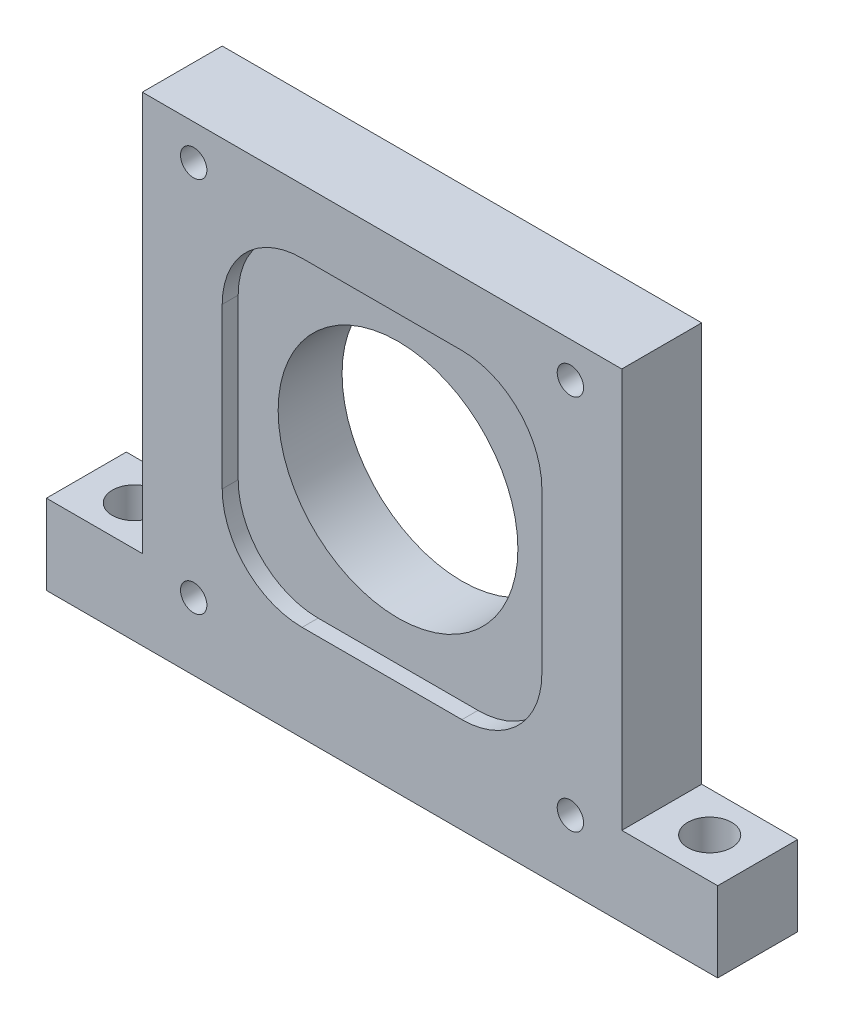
ISO-10303-21;
HEADER;
FILE_DESCRIPTION(('STEP AP214'),'2;1');
FILE_NAME('part.step','',(''),(''),'','','');
FILE_SCHEMA(('AUTOMOTIVE_DESIGN { 1 0 10303 214 1 1 1 1 }'));
ENDSEC;
DATA;
#1=APPLICATION_CONTEXT('core data for automotive mechanical design processes');
#2=APPLICATION_PROTOCOL_DEFINITION('international standard','automotive_design',2000,#1);
#3=PRODUCT_CONTEXT('',#1,'mechanical');
#4=PRODUCT('Part','Part','',(#3));
#5=PRODUCT_RELATED_PRODUCT_CATEGORY('part','',(#4));
#6=PRODUCT_DEFINITION_FORMATION('','',#4);
#7=PRODUCT_DEFINITION_CONTEXT('part definition',#1,'design');
#8=PRODUCT_DEFINITION('design','',#6,#7);
#9=PRODUCT_DEFINITION_SHAPE('','',#8);
#10=(LENGTH_UNIT() NAMED_UNIT(*) SI_UNIT(.MILLI.,.METRE.));
#11=(NAMED_UNIT(*) PLANE_ANGLE_UNIT() SI_UNIT($,.RADIAN.));
#12=(NAMED_UNIT(*) SI_UNIT($,.STERADIAN.) SOLID_ANGLE_UNIT());
#13=UNCERTAINTY_MEASURE_WITH_UNIT(LENGTH_MEASURE(1.E-05),#10,'distance_accuracy_value','');
#14=(GEOMETRIC_REPRESENTATION_CONTEXT(3) GLOBAL_UNCERTAINTY_ASSIGNED_CONTEXT((#13)) GLOBAL_UNIT_ASSIGNED_CONTEXT((#10,
#11,#12)) REPRESENTATION_CONTEXT('',''));
#15=CARTESIAN_POINT('',(0.,0.,0.));
#16=DIRECTION('',(0.,0.,1.));
#17=DIRECTION('',(1.,0.,0.));
#18=AXIS2_PLACEMENT_3D('',#15,#16,#17);
#19=CARTESIAN_POINT('',(20.,22.,8.));
#20=DIRECTION('',(1.,0.,0.));
#21=DIRECTION('',(0.,1.,0.));
#22=AXIS2_PLACEMENT_3D('',#19,#20,#21);
#23=PLANE('',#22);
#24=DIRECTION('',(0.,0.,-1.));
#25=VECTOR('',#24,1.);
#26=CARTESIAN_POINT('',(20.,-8.,8.));
#27=LINE('',#26,#25);
#28=CARTESIAN_POINT('',(20.,-8.,8.));
#29=VERTEX_POINT('',#28);
#30=CARTESIAN_POINT('',(20.,-8.,10.));
#31=VERTEX_POINT('',#30);
#32=EDGE_CURVE('E176',#29,#31,#27,.F.);
#33=ORIENTED_EDGE('',*,*,#32,.T.);
#34=DIRECTION('',(0.,1.,0.));
#35=VECTOR('',#34,1.);
#36=CARTESIAN_POINT('',(20.,0.,10.));
#37=LINE('',#36,#35);
#38=CARTESIAN_POINT('',(20.,12.,10.));
#39=VERTEX_POINT('',#38);
#40=EDGE_CURVE('E241',#39,#31,#37,.F.);
#41=ORIENTED_EDGE('',*,*,#40,.F.);
#42=DIRECTION('',(0.,0.,-1.));
#43=VECTOR('',#42,1.);
#44=CARTESIAN_POINT('',(20.,12.,8.));
#45=LINE('',#44,#43);
#46=CARTESIAN_POINT('',(20.,12.,8.));
#47=VERTEX_POINT('',#46);
#48=EDGE_CURVE('E162',#39,#47,#45,.T.);
#49=ORIENTED_EDGE('',*,*,#48,.T.);
#50=DIRECTION('',(0.,1.,0.));
#51=VECTOR('',#50,1.);
#52=CARTESIAN_POINT('',(20.,0.,8.));
#53=LINE('',#52,#51);
#54=EDGE_CURVE('E157',#29,#47,#53,.T.);
#55=ORIENTED_EDGE('',*,*,#54,.F.);
#56=EDGE_LOOP('',(#33,#41,#49,#55));
#57=FACE_BOUND('',#56,.T.);
#58=ADVANCED_FACE('F17',(#57),#23,.F.);
#59=CARTESIAN_POINT('',(10.,-8.,8.));
#60=DIRECTION('',(0.,0.,-1.));
#61=DIRECTION('',(-1.,0.,0.));
#62=AXIS2_PLACEMENT_3D('',#59,#60,#61);
#63=CYLINDRICAL_SURFACE('',#62,10.);
#64=DIRECTION('',(0.,0.,-1.));
#65=VECTOR('',#64,1.);
#66=CARTESIAN_POINT('',(10.,-18.,8.));
#67=LINE('',#66,#65);
#68=CARTESIAN_POINT('',(10.,-18.,8.));
#69=VERTEX_POINT('',#68);
#70=CARTESIAN_POINT('',(10.,-18.,10.));
#71=VERTEX_POINT('',#70);
#72=EDGE_CURVE('E142',#69,#71,#67,.F.);
#73=ORIENTED_EDGE('',*,*,#72,.T.);
#74=CARTESIAN_POINT('',(10.,-8.,10.));
#75=DIRECTION('',(0.,0.,-1.));
#76=DIRECTION('',(-1.,0.,0.));
#77=AXIS2_PLACEMENT_3D('',#74,#75,#76);
#78=CIRCLE('',#77,10.);
#79=EDGE_CURVE('E239',#31,#71,#78,.T.);
#80=ORIENTED_EDGE('',*,*,#79,.F.);
#81=ORIENTED_EDGE('',*,*,#32,.F.);
#82=CARTESIAN_POINT('',(10.,-8.,8.));
#83=DIRECTION('',(0.,0.,-1.));
#84=DIRECTION('',(-1.,0.,0.));
#85=AXIS2_PLACEMENT_3D('',#82,#83,#84);
#86=CIRCLE('',#85,10.);
#87=EDGE_CURVE('E155',#69,#29,#86,.F.);
#88=ORIENTED_EDGE('',*,*,#87,.F.);
#89=EDGE_LOOP('',(#73,#80,#81,#88));
#90=FACE_BOUND('',#89,.T.);
#91=ADVANCED_FACE('F273',(#90),#63,.F.);
#92=CARTESIAN_POINT('',(-20.,-18.,8.));
#93=DIRECTION('',(0.,-1.,0.));
#94=DIRECTION('',(0.,0.,-1.));
#95=AXIS2_PLACEMENT_3D('',#92,#93,#94);
#96=PLANE('',#95);
#97=DIRECTION('',(0.,0.,-1.));
#98=VECTOR('',#97,1.);
#99=CARTESIAN_POINT('',(-10.,-18.,8.));
#100=LINE('',#99,#98);
#101=CARTESIAN_POINT('',(-10.,-18.,8.));
#102=VERTEX_POINT('',#101);
#103=CARTESIAN_POINT('',(-10.,-18.,10.));
#104=VERTEX_POINT('',#103);
#105=EDGE_CURVE('E135',#102,#104,#100,.F.);
#106=ORIENTED_EDGE('',*,*,#105,.T.);
#107=DIRECTION('',(1.,0.,0.));
#108=VECTOR('',#107,1.);
#109=CARTESIAN_POINT('',(0.,-18.,10.));
#110=LINE('',#109,#108);
#111=EDGE_CURVE('E238',#71,#104,#110,.F.);
#112=ORIENTED_EDGE('',*,*,#111,.F.);
#113=ORIENTED_EDGE('',*,*,#72,.F.);
#114=DIRECTION('',(1.,0.,0.));
#115=VECTOR('',#114,1.);
#116=CARTESIAN_POINT('',(0.,-18.,8.));
#117=LINE('',#116,#115);
#118=EDGE_CURVE('E149',#102,#69,#117,.T.);
#119=ORIENTED_EDGE('',*,*,#118,.F.);
#120=EDGE_LOOP('',(#106,#112,#113,#119));
#121=FACE_BOUND('',#120,.T.);
#122=ADVANCED_FACE('F153',(#121),#96,.F.);
#123=CARTESIAN_POINT('',(-10.,-8.,8.));
#124=DIRECTION('',(0.,0.,-1.));
#125=DIRECTION('',(-1.,0.,0.));
#126=AXIS2_PLACEMENT_3D('',#123,#124,#125);
#127=CYLINDRICAL_SURFACE('',#126,10.);
#128=DIRECTION('',(0.,0.,1.));
#129=VECTOR('',#128,1.);
#130=CARTESIAN_POINT('',(-20.,-8.,8.));
#131=LINE('',#130,#129);
#132=CARTESIAN_POINT('',(-20.,-8.,8.));
#133=VERTEX_POINT('',#132);
#134=CARTESIAN_POINT('',(-20.,-8.,10.));
#135=VERTEX_POINT('',#134);
#136=EDGE_CURVE('E128',#133,#135,#131,.T.);
#137=ORIENTED_EDGE('',*,*,#136,.T.);
#138=CARTESIAN_POINT('',(-10.,-8.,10.));
#139=DIRECTION('',(0.,0.,-1.));
#140=DIRECTION('',(-1.,0.,0.));
#141=AXIS2_PLACEMENT_3D('',#138,#139,#140);
#142=CIRCLE('',#141,10.);
#143=EDGE_CURVE('E138',#104,#135,#142,.T.);
#144=ORIENTED_EDGE('',*,*,#143,.F.);
#145=ORIENTED_EDGE('',*,*,#105,.F.);
#146=CARTESIAN_POINT('',(-10.,-8.,8.));
#147=DIRECTION('',(0.,0.,-1.));
#148=DIRECTION('',(-1.,0.,0.));
#149=AXIS2_PLACEMENT_3D('',#146,#147,#148);
#150=CIRCLE('',#149,10.);
#151=EDGE_CURVE('E20',#133,#102,#150,.F.);
#152=ORIENTED_EDGE('',*,*,#151,.F.);
#153=EDGE_LOOP('',(#137,#144,#145,#152));
#154=FACE_BOUND('',#153,.T.);
#155=ADVANCED_FACE('F137',(#154),#127,.F.);
#156=CARTESIAN_POINT('',(-20.,22.,8.));
#157=DIRECTION('',(-1.,0.,0.));
#158=DIRECTION('',(0.,-1.,0.));
#159=AXIS2_PLACEMENT_3D('',#156,#157,#158);
#160=PLANE('',#159);
#161=ORIENTED_EDGE('',*,*,#136,.F.);
#162=DIRECTION('',(0.,1.,0.));
#163=VECTOR('',#162,1.);
#164=CARTESIAN_POINT('',(-20.,0.,8.));
#165=LINE('',#164,#163);
#166=CARTESIAN_POINT('',(-20.,12.,8.));
#167=VERTEX_POINT('',#166);
#168=EDGE_CURVE('E152',#167,#133,#165,.F.);
#169=ORIENTED_EDGE('',*,*,#168,.F.);
#170=DIRECTION('',(0.,0.,-1.));
#171=VECTOR('',#170,1.);
#172=CARTESIAN_POINT('',(-20.,12.,8.));
#173=LINE('',#172,#171);
#174=CARTESIAN_POINT('',(-20.,12.,10.));
#175=VERTEX_POINT('',#174);
#176=EDGE_CURVE('E171',#167,#175,#173,.F.);
#177=ORIENTED_EDGE('',*,*,#176,.T.);
#178=DIRECTION('',(0.,1.,0.));
#179=VECTOR('',#178,1.);
#180=CARTESIAN_POINT('',(-20.,0.,10.));
#181=LINE('',#180,#179);
#182=EDGE_CURVE('E236',#135,#175,#181,.T.);
#183=ORIENTED_EDGE('',*,*,#182,.F.);
#184=EDGE_LOOP('',(#161,#169,#177,#183));
#185=FACE_BOUND('',#184,.T.);
#186=ADVANCED_FACE('F262',(#185),#160,.F.);
#187=CARTESIAN_POINT('',(-10.,12.,8.));
#188=DIRECTION('',(0.,0.,-1.));
#189=DIRECTION('',(-1.,0.,0.));
#190=AXIS2_PLACEMENT_3D('',#187,#188,#189);
#191=CYLINDRICAL_SURFACE('',#190,10.);
#192=DIRECTION('',(0.,0.,1.));
#193=VECTOR('',#192,1.);
#194=CARTESIAN_POINT('',(-10.,22.,8.));
#195=LINE('',#194,#193);
#196=CARTESIAN_POINT('',(-10.,22.,8.));
#197=VERTEX_POINT('',#196);
#198=CARTESIAN_POINT('',(-10.,22.,10.));
#199=VERTEX_POINT('',#198);
#200=EDGE_CURVE('E166',#197,#199,#195,.T.);
#201=ORIENTED_EDGE('',*,*,#200,.T.);
#202=CARTESIAN_POINT('',(-10.,12.,10.));
#203=DIRECTION('',(0.,0.,-1.));
#204=DIRECTION('',(-1.,0.,0.));
#205=AXIS2_PLACEMENT_3D('',#202,#203,#204);
#206=CIRCLE('',#205,10.);
#207=EDGE_CURVE('E234',#175,#199,#206,.T.);
#208=ORIENTED_EDGE('',*,*,#207,.F.);
#209=ORIENTED_EDGE('',*,*,#176,.F.);
#210=CARTESIAN_POINT('',(-10.,12.,8.));
#211=DIRECTION('',(0.,0.,-1.));
#212=DIRECTION('',(-1.,0.,0.));
#213=AXIS2_PLACEMENT_3D('',#210,#211,#212);
#214=CIRCLE('',#213,10.);
#215=EDGE_CURVE('E242',#197,#167,#214,.F.);
#216=ORIENTED_EDGE('',*,*,#215,.F.);
#217=EDGE_LOOP('',(#201,#208,#209,#216));
#218=FACE_BOUND('',#217,.T.);
#219=ADVANCED_FACE('F260',(#218),#191,.F.);
#220=CARTESIAN_POINT('',(-20.,22.,8.));
#221=DIRECTION('',(0.,1.,0.));
#222=DIRECTION('',(0.,0.,1.));
#223=AXIS2_PLACEMENT_3D('',#220,#221,#222);
#224=PLANE('',#223);
#225=DIRECTION('',(0.,0.,-1.));
#226=VECTOR('',#225,1.);
#227=CARTESIAN_POINT('',(10.,22.,8.));
#228=LINE('',#227,#226);
#229=CARTESIAN_POINT('',(10.,22.,8.));
#230=VERTEX_POINT('',#229);
#231=CARTESIAN_POINT('',(10.,22.,10.));
#232=VERTEX_POINT('',#231);
#233=EDGE_CURVE('E163',#230,#232,#228,.F.);
#234=ORIENTED_EDGE('',*,*,#233,.T.);
#235=DIRECTION('',(1.,0.,0.));
#236=VECTOR('',#235,1.);
#237=CARTESIAN_POINT('',(0.,22.,10.));
#238=LINE('',#237,#236);
#239=EDGE_CURVE('E233',#199,#232,#238,.T.);
#240=ORIENTED_EDGE('',*,*,#239,.F.);
#241=ORIENTED_EDGE('',*,*,#200,.F.);
#242=DIRECTION('',(1.,0.,0.));
#243=VECTOR('',#242,1.);
#244=CARTESIAN_POINT('',(0.,22.,8.));
#245=LINE('',#244,#243);
#246=EDGE_CURVE('E244',#230,#197,#245,.F.);
#247=ORIENTED_EDGE('',*,*,#246,.F.);
#248=EDGE_LOOP('',(#234,#240,#241,#247));
#249=FACE_BOUND('',#248,.T.);
#250=ADVANCED_FACE('F257',(#249),#224,.F.);
#251=CARTESIAN_POINT('',(10.,12.,8.));
#252=DIRECTION('',(0.,0.,-1.));
#253=DIRECTION('',(-1.,0.,0.));
#254=AXIS2_PLACEMENT_3D('',#251,#252,#253);
#255=CYLINDRICAL_SURFACE('',#254,10.);
#256=ORIENTED_EDGE('',*,*,#48,.F.);
#257=CARTESIAN_POINT('',(10.,12.,10.));
#258=DIRECTION('',(0.,0.,-1.));
#259=DIRECTION('',(-1.,0.,0.));
#260=AXIS2_PLACEMENT_3D('',#257,#258,#259);
#261=CIRCLE('',#260,10.);
#262=EDGE_CURVE('E230',#232,#39,#261,.T.);
#263=ORIENTED_EDGE('',*,*,#262,.F.);
#264=ORIENTED_EDGE('',*,*,#233,.F.);
#265=CARTESIAN_POINT('',(10.,12.,8.));
#266=DIRECTION('',(0.,0.,-1.));
#267=DIRECTION('',(-1.,0.,0.));
#268=AXIS2_PLACEMENT_3D('',#265,#266,#267);
#269=CIRCLE('',#268,10.);
#270=EDGE_CURVE('E245',#47,#230,#269,.F.);
#271=ORIENTED_EDGE('',*,*,#270,.F.);
#272=EDGE_LOOP('',(#256,#263,#264,#271));
#273=FACE_BOUND('',#272,.T.);
#274=ADVANCED_FACE('F254',(#273),#255,.F.);
#275=CARTESIAN_POINT('',(0.,0.,8.));
#276=DIRECTION('',(0.,0.,1.));
#277=DIRECTION('',(1.,0.,0.));
#278=AXIS2_PLACEMENT_3D('',#275,#276,#277);
#279=PLANE('',#278);
#280=CARTESIAN_POINT('',(0.,2.,8.));
#281=DIRECTION('',(0.,0.,1.));
#282=DIRECTION('',(1.,0.,0.));
#283=AXIS2_PLACEMENT_3D('',#280,#281,#282);
#284=CIRCLE('',#283,15.);
#285=CARTESIAN_POINT('',(15.,2.,8.));
#286=VERTEX_POINT('',#285);
#287=EDGE_CURVE('E214',#286,#286,#284,.F.);
#288=ORIENTED_EDGE('',*,*,#287,.T.);
#289=EDGE_LOOP('',(#288));
#290=FACE_BOUND('',#289,.T.);
#291=ORIENTED_EDGE('',*,*,#246,.T.);
#292=ORIENTED_EDGE('',*,*,#215,.T.);
#293=ORIENTED_EDGE('',*,*,#168,.T.);
#294=ORIENTED_EDGE('',*,*,#151,.T.);
#295=ORIENTED_EDGE('',*,*,#118,.T.);
#296=ORIENTED_EDGE('',*,*,#87,.T.);
#297=ORIENTED_EDGE('',*,*,#54,.T.);
#298=ORIENTED_EDGE('',*,*,#270,.T.);
#299=EDGE_LOOP('',(#291,#292,#293,#294,#295,#296,#297,#298));
#300=FACE_BOUND('',#299,.T.);
#301=ADVANCED_FACE('F147',(#290,#300),#279,.T.);
#302=CARTESIAN_POINT('',(-36.,-30.,5.));
#303=DIRECTION('',(0.,1.,0.));
#304=DIRECTION('',(0.,0.,1.));
#305=AXIS2_PLACEMENT_3D('',#302,#303,#304);
#306=CYLINDRICAL_SURFACE('',#305,2.75);
#307=CARTESIAN_POINT('',(-36.,-30.,5.));
#308=DIRECTION('',(0.,1.,0.));
#309=DIRECTION('',(0.,0.,1.));
#310=AXIS2_PLACEMENT_3D('',#307,#308,#309);
#311=CIRCLE('',#310,2.75);
#312=CARTESIAN_POINT('',(-36.,-30.,7.75));
#313=VERTEX_POINT('',#312);
#314=EDGE_CURVE('E201',#313,#313,#311,.F.);
#315=ORIENTED_EDGE('',*,*,#314,.T.);
#316=EDGE_LOOP('',(#315));
#317=FACE_BOUND('',#316,.T.);
#318=CARTESIAN_POINT('',(-36.,-20.,5.));
#319=DIRECTION('',(0.,1.,0.));
#320=DIRECTION('',(0.,0.,1.));
#321=AXIS2_PLACEMENT_3D('',#318,#319,#320);
#322=CIRCLE('',#321,2.75);
#323=CARTESIAN_POINT('',(-36.,-20.,7.75));
#324=VERTEX_POINT('',#323);
#325=EDGE_CURVE('E209',#324,#324,#322,.T.);
#326=ORIENTED_EDGE('',*,*,#325,.T.);
#327=EDGE_LOOP('',(#326));
#328=FACE_BOUND('',#327,.T.);
#329=ADVANCED_FACE('F346',(#317,#328),#306,.F.);
#330=CARTESIAN_POINT('',(36.,-30.,5.));
#331=DIRECTION('',(0.,1.,0.));
#332=DIRECTION('',(0.,0.,1.));
#333=AXIS2_PLACEMENT_3D('',#330,#331,#332);
#334=CYLINDRICAL_SURFACE('',#333,2.75);
#335=CARTESIAN_POINT('',(36.,-30.,5.));
#336=DIRECTION('',(0.,1.,0.));
#337=DIRECTION('',(0.,0.,1.));
#338=AXIS2_PLACEMENT_3D('',#335,#336,#337);
#339=CIRCLE('',#338,2.75);
#340=CARTESIAN_POINT('',(36.,-30.,7.75));
#341=VERTEX_POINT('',#340);
#342=EDGE_CURVE('E205',#341,#341,#339,.F.);
#343=ORIENTED_EDGE('',*,*,#342,.T.);
#344=EDGE_LOOP('',(#343));
#345=FACE_BOUND('',#344,.T.);
#346=CARTESIAN_POINT('',(36.,-20.,5.));
#347=DIRECTION('',(0.,1.,0.));
#348=DIRECTION('',(0.,0.,1.));
#349=AXIS2_PLACEMENT_3D('',#346,#347,#348);
#350=CIRCLE('',#349,2.75);
#351=CARTESIAN_POINT('',(36.,-20.,7.75));
#352=VERTEX_POINT('',#351);
#353=EDGE_CURVE('E196',#352,#352,#350,.T.);
#354=ORIENTED_EDGE('',*,*,#353,.T.);
#355=EDGE_LOOP('',(#354));
#356=FACE_BOUND('',#355,.T.);
#357=ADVANCED_FACE('F343',(#345,#356),#334,.F.);
#358=CARTESIAN_POINT('',(0.,0.,10.));
#359=DIRECTION('',(0.,0.,1.));
#360=DIRECTION('',(1.,0.,0.));
#361=AXIS2_PLACEMENT_3D('',#358,#359,#360);
#362=PLANE('',#361);
#363=ORIENTED_EDGE('',*,*,#239,.T.);
#364=ORIENTED_EDGE('',*,*,#262,.T.);
#365=ORIENTED_EDGE('',*,*,#40,.T.);
#366=ORIENTED_EDGE('',*,*,#79,.T.);
#367=ORIENTED_EDGE('',*,*,#111,.T.);
#368=ORIENTED_EDGE('',*,*,#143,.T.);
#369=ORIENTED_EDGE('',*,*,#182,.T.);
#370=ORIENTED_EDGE('',*,*,#207,.T.);
#371=EDGE_LOOP('',(#363,#364,#365,#366,#367,#368,#369,#370));
#372=FACE_BOUND('',#371,.T.);
#373=DIRECTION('',(1.,0.,0.));
#374=VECTOR('',#373,1.);
#375=CARTESIAN_POINT('',(-42.,-30.,10.));
#376=LINE('',#375,#374);
#377=CARTESIAN_POINT('',(-42.,-30.,10.));
#378=VERTEX_POINT('',#377);
#379=CARTESIAN_POINT('',(42.,-30.,10.));
#380=VERTEX_POINT('',#379);
#381=EDGE_CURVE('E629',#378,#380,#376,.T.);
#382=ORIENTED_EDGE('',*,*,#381,.T.);
#383=DIRECTION('',(0.,-1.,0.));
#384=VECTOR('',#383,1.);
#385=CARTESIAN_POINT('',(42.,30.,10.));
#386=LINE('',#385,#384);
#387=CARTESIAN_POINT('',(42.,-20.,10.));
#388=VERTEX_POINT('',#387);
#389=EDGE_CURVE('E200',#380,#388,#386,.F.);
#390=ORIENTED_EDGE('',*,*,#389,.T.);
#391=DIRECTION('',(1.,0.,0.));
#392=VECTOR('',#391,1.);
#393=CARTESIAN_POINT('',(42.,-20.,10.));
#394=LINE('',#393,#392);
#395=CARTESIAN_POINT('',(30.,-20.,10.));
#396=VERTEX_POINT('',#395);
#397=EDGE_CURVE('E596',#388,#396,#394,.F.);
#398=ORIENTED_EDGE('',*,*,#397,.T.);
#399=DIRECTION('',(0.,-1.,0.));
#400=VECTOR('',#399,1.);
#401=CARTESIAN_POINT('',(30.,30.,10.));
#402=LINE('',#401,#400);
#403=CARTESIAN_POINT('',(30.,30.,10.));
#404=VERTEX_POINT('',#403);
#405=EDGE_CURVE('E195',#396,#404,#402,.F.);
#406=ORIENTED_EDGE('',*,*,#405,.T.);
#407=DIRECTION('',(1.,0.,0.));
#408=VECTOR('',#407,1.);
#409=CARTESIAN_POINT('',(-42.,30.,10.));
#410=LINE('',#409,#408);
#411=CARTESIAN_POINT('',(-30.,30.,10.));
#412=VERTEX_POINT('',#411);
#413=EDGE_CURVE('E217',#404,#412,#410,.F.);
#414=ORIENTED_EDGE('',*,*,#413,.T.);
#415=DIRECTION('',(0.,1.,0.));
#416=VECTOR('',#415,1.);
#417=CARTESIAN_POINT('',(-30.,30.,10.));
#418=LINE('',#417,#416);
#419=CARTESIAN_POINT('',(-30.,-20.,10.));
#420=VERTEX_POINT('',#419);
#421=EDGE_CURVE('E213',#412,#420,#418,.F.);
#422=ORIENTED_EDGE('',*,*,#421,.T.);
#423=DIRECTION('',(1.,0.,0.));
#424=VECTOR('',#423,1.);
#425=CARTESIAN_POINT('',(-42.,-20.,10.));
#426=LINE('',#425,#424);
#427=CARTESIAN_POINT('',(-42.,-20.,10.));
#428=VERTEX_POINT('',#427);
#429=EDGE_CURVE('E637',#420,#428,#426,.F.);
#430=ORIENTED_EDGE('',*,*,#429,.T.);
#431=DIRECTION('',(0.,1.,0.));
#432=VECTOR('',#431,1.);
#433=CARTESIAN_POINT('',(-42.,30.,10.));
#434=LINE('',#433,#432);
#435=EDGE_CURVE('E208',#428,#378,#434,.F.);
#436=ORIENTED_EDGE('',*,*,#435,.T.);
#437=EDGE_LOOP('',(#382,#390,#398,#406,#414,#422,#430,#436));
#438=FACE_BOUND('',#437,.T.);
#439=CARTESIAN_POINT('',(-23.57,-21.57,10.));
#440=DIRECTION('',(0.,0.,1.));
#441=DIRECTION('',(1.,0.,0.));
#442=AXIS2_PLACEMENT_3D('',#439,#440,#441);
#443=CIRCLE('',#442,1.64999999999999);
#444=CARTESIAN_POINT('',(-21.92,-21.57,10.));
#445=VERTEX_POINT('',#444);
#446=EDGE_CURVE('E218',#445,#445,#443,.F.);
#447=ORIENTED_EDGE('',*,*,#446,.T.);
#448=EDGE_LOOP('',(#447));
#449=FACE_BOUND('',#448,.T.);
#450=CARTESIAN_POINT('',(23.57,-21.57,10.));
#451=DIRECTION('',(0.,0.,1.));
#452=DIRECTION('',(1.,0.,0.));
#453=AXIS2_PLACEMENT_3D('',#450,#451,#452);
#454=CIRCLE('',#453,1.64999999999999);
#455=CARTESIAN_POINT('',(25.22,-21.57,10.));
#456=VERTEX_POINT('',#455);
#457=EDGE_CURVE('E221',#456,#456,#454,.F.);
#458=ORIENTED_EDGE('',*,*,#457,.T.);
#459=EDGE_LOOP('',(#458));
#460=FACE_BOUND('',#459,.T.);
#461=CARTESIAN_POINT('',(23.57,25.57,10.));
#462=DIRECTION('',(0.,0.,1.));
#463=DIRECTION('',(1.,0.,0.));
#464=AXIS2_PLACEMENT_3D('',#461,#462,#463);
#465=CIRCLE('',#464,1.64999999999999);
#466=CARTESIAN_POINT('',(25.22,25.57,10.));
#467=VERTEX_POINT('',#466);
#468=EDGE_CURVE('E224',#467,#467,#465,.F.);
#469=ORIENTED_EDGE('',*,*,#468,.T.);
#470=EDGE_LOOP('',(#469));
#471=FACE_BOUND('',#470,.T.);
#472=CARTESIAN_POINT('',(-23.57,25.57,10.));
#473=DIRECTION('',(0.,0.,1.));
#474=DIRECTION('',(1.,0.,0.));
#475=AXIS2_PLACEMENT_3D('',#472,#473,#474);
#476=CIRCLE('',#475,1.64999999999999);
#477=CARTESIAN_POINT('',(-21.92,25.57,10.));
#478=VERTEX_POINT('',#477);
#479=EDGE_CURVE('E227',#478,#478,#476,.F.);
#480=ORIENTED_EDGE('',*,*,#479,.T.);
#481=EDGE_LOOP('',(#480));
#482=FACE_BOUND('',#481,.T.);
#483=ADVANCED_FACE('F269',(#372,#438,#449,#460,#471,#482),#362,.T.);
#484=CARTESIAN_POINT('',(-23.57,25.57,10.));
#485=DIRECTION('',(0.,0.,1.));
#486=DIRECTION('',(1.,0.,0.));
#487=AXIS2_PLACEMENT_3D('',#484,#485,#486);
#488=CYLINDRICAL_SURFACE('',#487,1.64999999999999);
#489=CARTESIAN_POINT('',(-23.57,25.57,0.));
#490=DIRECTION('',(0.,0.,1.));
#491=DIRECTION('',(1.,0.,0.));
#492=AXIS2_PLACEMENT_3D('',#489,#490,#491);
#493=CIRCLE('',#492,1.64999999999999);
#494=CARTESIAN_POINT('',(-21.92,25.57,0.));
#495=VERTEX_POINT('',#494);
#496=EDGE_CURVE('E192',#495,#495,#493,.F.);
#497=ORIENTED_EDGE('',*,*,#496,.T.);
#498=EDGE_LOOP('',(#497));
#499=FACE_BOUND('',#498,.T.);
#500=ORIENTED_EDGE('',*,*,#479,.F.);
#501=EDGE_LOOP('',(#500));
#502=FACE_BOUND('',#501,.T.);
#503=ADVANCED_FACE('F336',(#499,#502),#488,.F.);
#504=CARTESIAN_POINT('',(23.57,25.57,10.));
#505=DIRECTION('',(0.,0.,1.));
#506=DIRECTION('',(1.,0.,0.));
#507=AXIS2_PLACEMENT_3D('',#504,#505,#506);
#508=CYLINDRICAL_SURFACE('',#507,1.64999999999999);
#509=CARTESIAN_POINT('',(23.57,25.57,0.));
#510=DIRECTION('',(0.,0.,1.));
#511=DIRECTION('',(1.,0.,0.));
#512=AXIS2_PLACEMENT_3D('',#509,#510,#511);
#513=CIRCLE('',#512,1.64999999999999);
#514=CARTESIAN_POINT('',(25.22,25.57,0.));
#515=VERTEX_POINT('',#514);
#516=EDGE_CURVE('E189',#515,#515,#513,.F.);
#517=ORIENTED_EDGE('',*,*,#516,.T.);
#518=EDGE_LOOP('',(#517));
#519=FACE_BOUND('',#518,.T.);
#520=ORIENTED_EDGE('',*,*,#468,.F.);
#521=EDGE_LOOP('',(#520));
#522=FACE_BOUND('',#521,.T.);
#523=ADVANCED_FACE('F332',(#519,#522),#508,.F.);
#524=CARTESIAN_POINT('',(23.57,-21.57,10.));
#525=DIRECTION('',(0.,0.,1.));
#526=DIRECTION('',(1.,0.,0.));
#527=AXIS2_PLACEMENT_3D('',#524,#525,#526);
#528=CYLINDRICAL_SURFACE('',#527,1.64999999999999);
#529=CARTESIAN_POINT('',(23.57,-21.57,0.));
#530=DIRECTION('',(0.,0.,1.));
#531=DIRECTION('',(1.,0.,0.));
#532=AXIS2_PLACEMENT_3D('',#529,#530,#531);
#533=CIRCLE('',#532,1.64999999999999);
#534=CARTESIAN_POINT('',(25.22,-21.57,0.));
#535=VERTEX_POINT('',#534);
#536=EDGE_CURVE('E186',#535,#535,#533,.F.);
#537=ORIENTED_EDGE('',*,*,#536,.T.);
#538=EDGE_LOOP('',(#537));
#539=FACE_BOUND('',#538,.T.);
#540=ORIENTED_EDGE('',*,*,#457,.F.);
#541=EDGE_LOOP('',(#540));
#542=FACE_BOUND('',#541,.T.);
#543=ADVANCED_FACE('F328',(#539,#542),#528,.F.);
#544=CARTESIAN_POINT('',(-23.57,-21.57,10.));
#545=DIRECTION('',(0.,0.,1.));
#546=DIRECTION('',(1.,0.,0.));
#547=AXIS2_PLACEMENT_3D('',#544,#545,#546);
#548=CYLINDRICAL_SURFACE('',#547,1.64999999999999);
#549=CARTESIAN_POINT('',(-23.57,-21.57,0.));
#550=DIRECTION('',(0.,0.,1.));
#551=DIRECTION('',(1.,0.,0.));
#552=AXIS2_PLACEMENT_3D('',#549,#550,#551);
#553=CIRCLE('',#552,1.64999999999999);
#554=CARTESIAN_POINT('',(-21.92,-21.57,0.));
#555=VERTEX_POINT('',#554);
#556=EDGE_CURVE('E183',#555,#555,#553,.F.);
#557=ORIENTED_EDGE('',*,*,#556,.T.);
#558=EDGE_LOOP('',(#557));
#559=FACE_BOUND('',#558,.T.);
#560=ORIENTED_EDGE('',*,*,#446,.F.);
#561=EDGE_LOOP('',(#560));
#562=FACE_BOUND('',#561,.T.);
#563=ADVANCED_FACE('F324',(#559,#562),#548,.F.);
#564=CARTESIAN_POINT('',(0.,2.,-2.));
#565=DIRECTION('',(0.,0.,1.));
#566=DIRECTION('',(1.,0.,0.));
#567=AXIS2_PLACEMENT_3D('',#564,#565,#566);
#568=CYLINDRICAL_SURFACE('',#567,15.);
#569=CARTESIAN_POINT('',(0.,2.,0.));
#570=DIRECTION('',(0.,0.,1.));
#571=DIRECTION('',(1.,0.,0.));
#572=AXIS2_PLACEMENT_3D('',#569,#570,#571);
#573=CIRCLE('',#572,15.);
#574=CARTESIAN_POINT('',(15.,2.,0.));
#575=VERTEX_POINT('',#574);
#576=EDGE_CURVE('E179',#575,#575,#573,.F.);
#577=ORIENTED_EDGE('',*,*,#576,.T.);
#578=EDGE_LOOP('',(#577));
#579=FACE_BOUND('',#578,.T.);
#580=ORIENTED_EDGE('',*,*,#287,.F.);
#581=EDGE_LOOP('',(#580));
#582=FACE_BOUND('',#581,.T.);
#583=ADVANCED_FACE('F320',(#579,#582),#568,.F.);
#584=CARTESIAN_POINT('',(-42.,30.,10.));
#585=DIRECTION('',(0.,-1.,0.));
#586=DIRECTION('',(0.,0.,-1.));
#587=AXIS2_PLACEMENT_3D('',#584,#585,#586);
#588=PLANE('',#587);
#589=DIRECTION('',(0.,0.,1.));
#590=VECTOR('',#589,1.);
#591=CARTESIAN_POINT('',(30.,30.,0.));
#592=LINE('',#591,#590);
#593=CARTESIAN_POINT('',(30.,30.,0.));
#594=VERTEX_POINT('',#593);
#595=EDGE_CURVE('E593',#404,#594,#592,.F.);
#596=ORIENTED_EDGE('',*,*,#595,.T.);
#597=DIRECTION('',(1.,0.,0.));
#598=VECTOR('',#597,1.);
#599=CARTESIAN_POINT('',(0.,30.,0.));
#600=LINE('',#599,#598);
#601=CARTESIAN_POINT('',(-30.,30.,0.));
#602=VERTEX_POINT('',#601);
#603=EDGE_CURVE('E182',#594,#602,#600,.F.);
#604=ORIENTED_EDGE('',*,*,#603,.T.);
#605=DIRECTION('',(0.,0.,1.));
#606=VECTOR('',#605,1.);
#607=CARTESIAN_POINT('',(-30.,30.,0.));
#608=LINE('',#607,#606);
#609=EDGE_CURVE('E642',#602,#412,#608,.T.);
#610=ORIENTED_EDGE('',*,*,#609,.T.);
#611=ORIENTED_EDGE('',*,*,#413,.F.);
#612=EDGE_LOOP('',(#596,#604,#610,#611));
#613=FACE_BOUND('',#612,.T.);
#614=ADVANCED_FACE('F316',(#613),#588,.F.);
#615=CARTESIAN_POINT('',(-30.,30.,0.));
#616=DIRECTION('',(1.,0.,0.));
#617=DIRECTION('',(0.,1.,0.));
#618=AXIS2_PLACEMENT_3D('',#615,#616,#617);
#619=PLANE('',#618);
#620=ORIENTED_EDGE('',*,*,#609,.F.);
#621=DIRECTION('',(0.,1.,0.));
#622=VECTOR('',#621,1.);
#623=CARTESIAN_POINT('',(-30.,0.,0.));
#624=LINE('',#623,#622);
#625=CARTESIAN_POINT('',(-30.,-20.,0.));
#626=VERTEX_POINT('',#625);
#627=EDGE_CURVE('E617',#602,#626,#624,.F.);
#628=ORIENTED_EDGE('',*,*,#627,.T.);
#629=DIRECTION('',(0.,0.,-1.));
#630=VECTOR('',#629,1.);
#631=CARTESIAN_POINT('',(-30.,-20.,0.));
#632=LINE('',#631,#630);
#633=EDGE_CURVE('E212',#626,#420,#632,.F.);
#634=ORIENTED_EDGE('',*,*,#633,.T.);
#635=ORIENTED_EDGE('',*,*,#421,.F.);
#636=EDGE_LOOP('',(#620,#628,#634,#635));
#637=FACE_BOUND('',#636,.T.);
#638=ADVANCED_FACE('F312',(#637),#619,.F.);
#639=CARTESIAN_POINT('',(-42.,-20.,0.));
#640=DIRECTION('',(0.,-1.,0.));
#641=DIRECTION('',(0.,0.,-1.));
#642=AXIS2_PLACEMENT_3D('',#639,#640,#641);
#643=PLANE('',#642);
#644=ORIENTED_EDGE('',*,*,#633,.F.);
#645=DIRECTION('',(1.,0.,0.));
#646=VECTOR('',#645,1.);
#647=CARTESIAN_POINT('',(0.,-20.,0.));
#648=LINE('',#647,#646);
#649=CARTESIAN_POINT('',(-42.,-20.,0.));
#650=VERTEX_POINT('',#649);
#651=EDGE_CURVE('E614',#626,#650,#648,.F.);
#652=ORIENTED_EDGE('',*,*,#651,.T.);
#653=DIRECTION('',(0.,0.,1.));
#654=VECTOR('',#653,1.);
#655=CARTESIAN_POINT('',(-42.,-20.,10.));
#656=LINE('',#655,#654);
#657=EDGE_CURVE('E634',#650,#428,#656,.T.);
#658=ORIENTED_EDGE('',*,*,#657,.T.);
#659=ORIENTED_EDGE('',*,*,#429,.F.);
#660=EDGE_LOOP('',(#644,#652,#658,#659));
#661=FACE_BOUND('',#660,.T.);
#662=ORIENTED_EDGE('',*,*,#325,.F.);
#663=EDGE_LOOP('',(#662));
#664=FACE_BOUND('',#663,.T.);
#665=ADVANCED_FACE('F308',(#661,#664),#643,.F.);
#666=CARTESIAN_POINT('',(-42.,30.,10.));
#667=DIRECTION('',(1.,0.,0.));
#668=DIRECTION('',(0.,1.,0.));
#669=AXIS2_PLACEMENT_3D('',#666,#667,#668);
#670=PLANE('',#669);
#671=ORIENTED_EDGE('',*,*,#657,.F.);
#672=DIRECTION('',(0.,1.,0.));
#673=VECTOR('',#672,1.);
#674=CARTESIAN_POINT('',(-42.,0.,0.));
#675=LINE('',#674,#673);
#676=CARTESIAN_POINT('',(-42.,-30.,0.));
#677=VERTEX_POINT('',#676);
#678=EDGE_CURVE('E611',#650,#677,#675,.F.);
#679=ORIENTED_EDGE('',*,*,#678,.T.);
#680=DIRECTION('',(0.,0.,1.));
#681=VECTOR('',#680,1.);
#682=CARTESIAN_POINT('',(-42.,-30.,10.));
#683=LINE('',#682,#681);
#684=EDGE_CURVE('E204',#677,#378,#683,.T.);
#685=ORIENTED_EDGE('',*,*,#684,.T.);
#686=ORIENTED_EDGE('',*,*,#435,.F.);
#687=EDGE_LOOP('',(#671,#679,#685,#686));
#688=FACE_BOUND('',#687,.T.);
#689=ADVANCED_FACE('F304',(#688),#670,.F.);
#690=CARTESIAN_POINT('',(-42.,-30.,10.));
#691=DIRECTION('',(0.,1.,0.));
#692=DIRECTION('',(0.,0.,1.));
#693=AXIS2_PLACEMENT_3D('',#690,#691,#692);
#694=PLANE('',#693);
#695=DIRECTION('',(0.,0.,1.));
#696=VECTOR('',#695,1.);
#697=CARTESIAN_POINT('',(42.,-30.,10.));
#698=LINE('',#697,#696);
#699=CARTESIAN_POINT('',(42.,-30.,0.));
#700=VERTEX_POINT('',#699);
#701=EDGE_CURVE('E626',#700,#380,#698,.T.);
#702=ORIENTED_EDGE('',*,*,#701,.T.);
#703=ORIENTED_EDGE('',*,*,#381,.F.);
#704=ORIENTED_EDGE('',*,*,#684,.F.);
#705=DIRECTION('',(1.,0.,0.));
#706=VECTOR('',#705,1.);
#707=CARTESIAN_POINT('',(0.,-30.,0.));
#708=LINE('',#707,#706);
#709=EDGE_CURVE('E606',#677,#700,#708,.T.);
#710=ORIENTED_EDGE('',*,*,#709,.T.);
#711=EDGE_LOOP('',(#702,#703,#704,#710));
#712=FACE_BOUND('',#711,.T.);
#713=ORIENTED_EDGE('',*,*,#314,.F.);
#714=EDGE_LOOP('',(#713));
#715=FACE_BOUND('',#714,.T.);
#716=ORIENTED_EDGE('',*,*,#342,.F.);
#717=EDGE_LOOP('',(#716));
#718=FACE_BOUND('',#717,.T.);
#719=ADVANCED_FACE('F300',(#712,#715,#718),#694,.F.);
#720=CARTESIAN_POINT('',(42.,30.,10.));
#721=DIRECTION('',(-1.,0.,0.));
#722=DIRECTION('',(0.,-1.,0.));
#723=AXIS2_PLACEMENT_3D('',#720,#721,#722);
#724=PLANE('',#723);
#725=DIRECTION('',(0.,0.,-1.));
#726=VECTOR('',#725,1.);
#727=CARTESIAN_POINT('',(42.,-20.,0.));
#728=LINE('',#727,#726);
#729=CARTESIAN_POINT('',(42.,-20.,0.));
#730=VERTEX_POINT('',#729);
#731=EDGE_CURVE('E199',#730,#388,#728,.F.);
#732=ORIENTED_EDGE('',*,*,#731,.T.);
#733=ORIENTED_EDGE('',*,*,#389,.F.);
#734=ORIENTED_EDGE('',*,*,#701,.F.);
#735=DIRECTION('',(0.,1.,0.));
#736=VECTOR('',#735,1.);
#737=CARTESIAN_POINT('',(42.,0.,0.));
#738=LINE('',#737,#736);
#739=EDGE_CURVE('E604',#700,#730,#738,.T.);
#740=ORIENTED_EDGE('',*,*,#739,.T.);
#741=EDGE_LOOP('',(#732,#733,#734,#740));
#742=FACE_BOUND('',#741,.T.);
#743=ADVANCED_FACE('F296',(#742),#724,.F.);
#744=CARTESIAN_POINT('',(42.,-20.,0.));
#745=DIRECTION('',(0.,-1.,0.));
#746=DIRECTION('',(0.,0.,-1.));
#747=AXIS2_PLACEMENT_3D('',#744,#745,#746);
#748=PLANE('',#747);
#749=ORIENTED_EDGE('',*,*,#731,.F.);
#750=DIRECTION('',(1.,0.,0.));
#751=VECTOR('',#750,1.);
#752=CARTESIAN_POINT('',(0.,-20.,0.));
#753=LINE('',#752,#751);
#754=CARTESIAN_POINT('',(30.,-20.,0.));
#755=VERTEX_POINT('',#754);
#756=EDGE_CURVE('E26',#730,#755,#753,.F.);
#757=ORIENTED_EDGE('',*,*,#756,.T.);
#758=DIRECTION('',(0.,0.,1.));
#759=VECTOR('',#758,1.);
#760=CARTESIAN_POINT('',(30.,-20.,0.));
#761=LINE('',#760,#759);
#762=EDGE_CURVE('E34',#755,#396,#761,.T.);
#763=ORIENTED_EDGE('',*,*,#762,.T.);
#764=ORIENTED_EDGE('',*,*,#397,.F.);
#765=EDGE_LOOP('',(#749,#757,#763,#764));
#766=FACE_BOUND('',#765,.T.);
#767=ORIENTED_EDGE('',*,*,#353,.F.);
#768=EDGE_LOOP('',(#767));
#769=FACE_BOUND('',#768,.T.);
#770=ADVANCED_FACE('F289',(#766,#769),#748,.F.);
#771=CARTESIAN_POINT('',(30.,30.,0.));
#772=DIRECTION('',(-1.,0.,0.));
#773=DIRECTION('',(0.,-1.,0.));
#774=AXIS2_PLACEMENT_3D('',#771,#772,#773);
#775=PLANE('',#774);
#776=ORIENTED_EDGE('',*,*,#762,.F.);
#777=DIRECTION('',(0.,1.,0.));
#778=VECTOR('',#777,1.);
#779=CARTESIAN_POINT('',(30.,0.,0.));
#780=LINE('',#779,#778);
#781=EDGE_CURVE('E11',#755,#594,#780,.T.);
#782=ORIENTED_EDGE('',*,*,#781,.T.);
#783=ORIENTED_EDGE('',*,*,#595,.F.);
#784=ORIENTED_EDGE('',*,*,#405,.F.);
#785=EDGE_LOOP('',(#776,#782,#783,#784));
#786=FACE_BOUND('',#785,.T.);
#787=ADVANCED_FACE('F283',(#786),#775,.F.);
#788=CARTESIAN_POINT('',(0.,0.,0.));
#789=DIRECTION('',(0.,0.,1.));
#790=DIRECTION('',(1.,0.,0.));
#791=AXIS2_PLACEMENT_3D('',#788,#789,#790);
#792=PLANE('',#791);
#793=ORIENTED_EDGE('',*,*,#756,.F.);
#794=ORIENTED_EDGE('',*,*,#739,.F.);
#795=ORIENTED_EDGE('',*,*,#709,.F.);
#796=ORIENTED_EDGE('',*,*,#678,.F.);
#797=ORIENTED_EDGE('',*,*,#651,.F.);
#798=ORIENTED_EDGE('',*,*,#627,.F.);
#799=ORIENTED_EDGE('',*,*,#603,.F.);
#800=ORIENTED_EDGE('',*,*,#781,.F.);
#801=EDGE_LOOP('',(#793,#794,#795,#796,#797,#798,#799,#800));
#802=FACE_BOUND('',#801,.T.);
#803=ORIENTED_EDGE('',*,*,#576,.F.);
#804=EDGE_LOOP('',(#803));
#805=FACE_BOUND('',#804,.T.);
#806=ORIENTED_EDGE('',*,*,#556,.F.);
#807=EDGE_LOOP('',(#806));
#808=FACE_BOUND('',#807,.T.);
#809=ORIENTED_EDGE('',*,*,#536,.F.);
#810=EDGE_LOOP('',(#809));
#811=FACE_BOUND('',#810,.T.);
#812=ORIENTED_EDGE('',*,*,#516,.F.);
#813=EDGE_LOOP('',(#812));
#814=FACE_BOUND('',#813,.T.);
#815=ORIENTED_EDGE('',*,*,#496,.F.);
#816=EDGE_LOOP('',(#815));
#817=FACE_BOUND('',#816,.T.);
#818=ADVANCED_FACE('F281',(#802,#805,#808,#811,#814,#817),#792,.F.);
#819=CLOSED_SHELL('',(#58,#91,#122,#155,#186,#219,#250,#274,#301,#329,#357,#483,#503,#523,#543,
#563,#583,#614,#638,#665,#689,#719,#743,#770,#787,#818));
#820=MANIFOLD_SOLID_BREP('B1',#819);
#821=ADVANCED_BREP_SHAPE_REPRESENTATION('',(#18,#820),#14);
#822=SHAPE_DEFINITION_REPRESENTATION(#9,#821);
ENDSEC;
END-ISO-10303-21;
